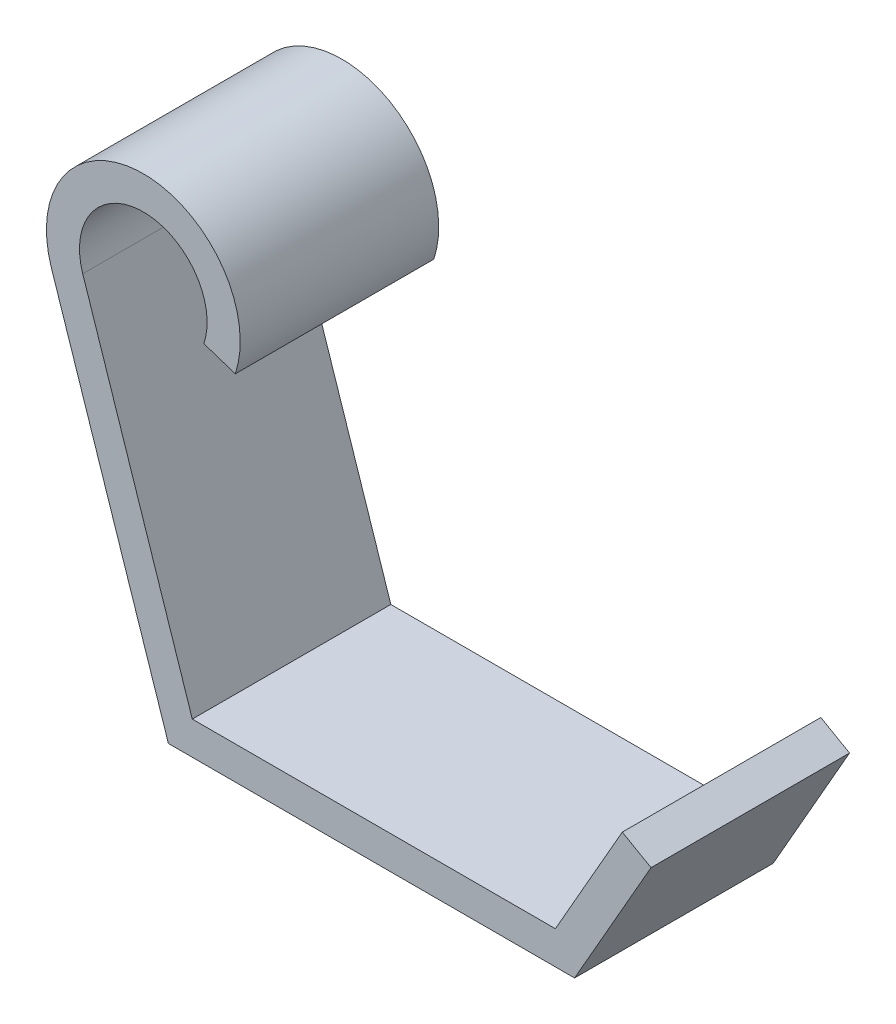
ISO-10303-21;
HEADER;
FILE_DESCRIPTION(('STEP AP214'),'2;1');
FILE_NAME('part.step','',(''),(''),'','','');
FILE_SCHEMA(('AUTOMOTIVE_DESIGN { 1 0 10303 214 1 1 1 1 }'));
ENDSEC;
DATA;
#1=APPLICATION_CONTEXT('core data for automotive mechanical design processes');
#2=APPLICATION_PROTOCOL_DEFINITION('international standard','automotive_design',2000,#1);
#3=PRODUCT_CONTEXT('',#1,'mechanical');
#4=PRODUCT('Part','Part','',(#3));
#5=PRODUCT_RELATED_PRODUCT_CATEGORY('part','',(#4));
#6=PRODUCT_DEFINITION_FORMATION('','',#4);
#7=PRODUCT_DEFINITION_CONTEXT('part definition',#1,'design');
#8=PRODUCT_DEFINITION('design','',#6,#7);
#9=PRODUCT_DEFINITION_SHAPE('','',#8);
#10=(LENGTH_UNIT() NAMED_UNIT(*) SI_UNIT(.MILLI.,.METRE.));
#11=(NAMED_UNIT(*) PLANE_ANGLE_UNIT() SI_UNIT($,.RADIAN.));
#12=(NAMED_UNIT(*) SI_UNIT($,.STERADIAN.) SOLID_ANGLE_UNIT());
#13=UNCERTAINTY_MEASURE_WITH_UNIT(LENGTH_MEASURE(1.E-05),#10,'distance_accuracy_value','');
#14=(GEOMETRIC_REPRESENTATION_CONTEXT(3) GLOBAL_UNCERTAINTY_ASSIGNED_CONTEXT((#13)) GLOBAL_UNIT_ASSIGNED_CONTEXT((#10,
#11,#12)) REPRESENTATION_CONTEXT('',''));
#15=CARTESIAN_POINT('',(0.,0.,0.));
#16=DIRECTION('',(0.,0.,1.));
#17=DIRECTION('',(1.,0.,0.));
#18=AXIS2_PLACEMENT_3D('',#15,#16,#17);
#19=CARTESIAN_POINT('',(-3.79088628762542,58.0354441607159,30.));
#20=DIRECTION('',(0.,0.,-1.));
#21=DIRECTION('',(-1.,0.,0.));
#22=AXIS2_PLACEMENT_3D('',#19,#20,#21);
#23=CYLINDRICAL_SURFACE('',#22,9.64192861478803);
#24=CARTESIAN_POINT('',(-3.79088628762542,58.0354441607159,0.));
#25=DIRECTION('',(0.,0.,1.));
#26=DIRECTION('',(1.,0.,0.));
#27=AXIS2_PLACEMENT_3D('',#24,#25,#26);
#28=CIRCLE('',#27,9.64192861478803);
#29=CARTESIAN_POINT('',(-12.9441887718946,55.0049588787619,0.));
#30=VERTEX_POINT('',#29);
#31=CARTESIAN_POINT('',(5.36241619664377,55.0049588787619,0.));
#32=VERTEX_POINT('',#31);
#33=EDGE_CURVE('E139',#30,#32,#28,.F.);
#34=ORIENTED_EDGE('',*,*,#33,.T.);
#35=DIRECTION('',(0.,0.,-1.));
#36=VECTOR('',#35,1.);
#37=CARTESIAN_POINT('',(5.36241619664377,55.0049588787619,30.));
#38=LINE('',#37,#36);
#39=CARTESIAN_POINT('',(5.36241619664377,55.0049588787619,30.));
#40=VERTEX_POINT('',#39);
#41=EDGE_CURVE('E11',#40,#32,#38,.T.);
#42=ORIENTED_EDGE('',*,*,#41,.F.);
#43=CARTESIAN_POINT('',(-3.79088628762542,58.0354441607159,30.));
#44=DIRECTION('',(0.,0.,1.));
#45=DIRECTION('',(1.,0.,0.));
#46=AXIS2_PLACEMENT_3D('',#43,#44,#45);
#47=CIRCLE('',#46,9.64192861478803);
#48=CARTESIAN_POINT('',(-12.9441887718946,55.0049588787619,30.));
#49=VERTEX_POINT('',#48);
#50=EDGE_CURVE('E94',#49,#40,#47,.F.);
#51=ORIENTED_EDGE('',*,*,#50,.F.);
#52=DIRECTION('',(0.,0.,-1.));
#53=VECTOR('',#52,1.);
#54=CARTESIAN_POINT('',(-12.9441887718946,55.0049588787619,30.));
#55=LINE('',#54,#53);
#56=EDGE_CURVE('E135',#49,#30,#55,.T.);
#57=ORIENTED_EDGE('',*,*,#56,.T.);
#58=EDGE_LOOP('',(#34,#42,#51,#57));
#59=FACE_BOUND('',#58,.T.);
#60=ADVANCED_FACE('F32',(#59),#23,.F.);
#61=CARTESIAN_POINT('',(10.1090301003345,53.4334448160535,30.));
#62=DIRECTION('',(-0.314302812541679,-0.949322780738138,0.));
#63=DIRECTION('',(0.949322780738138,-0.314302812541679,0.));
#64=AXIS2_PLACEMENT_3D('',#61,#62,#63);
#65=PLANE('',#64);
#66=DIRECTION('',(-0.949322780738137,0.314302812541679,0.));
#67=VECTOR('',#66,1.);
#68=CARTESIAN_POINT('',(10.1090301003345,53.4334448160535,0.));
#69=LINE('',#68,#67);
#70=CARTESIAN_POINT('',(10.1090301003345,53.4334448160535,0.));
#71=VERTEX_POINT('',#70);
#72=EDGE_CURVE('E142',#71,#32,#69,.T.);
#73=ORIENTED_EDGE('',*,*,#72,.F.);
#74=DIRECTION('',(0.,0.,-1.));
#75=VECTOR('',#74,1.);
#76=CARTESIAN_POINT('',(10.1090301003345,53.4334448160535,30.));
#77=LINE('',#76,#75);
#78=CARTESIAN_POINT('',(10.1090301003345,53.4334448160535,30.));
#79=VERTEX_POINT('',#78);
#80=EDGE_CURVE('E40',#79,#71,#77,.T.);
#81=ORIENTED_EDGE('',*,*,#80,.F.);
#82=DIRECTION('',(-0.949322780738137,0.314302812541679,0.));
#83=VECTOR('',#82,1.);
#84=CARTESIAN_POINT('',(10.1090301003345,53.4334448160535,30.));
#85=LINE('',#84,#83);
#86=EDGE_CURVE('E195',#79,#40,#85,.T.);
#87=ORIENTED_EDGE('',*,*,#86,.T.);
#88=ORIENTED_EDGE('',*,*,#41,.T.);
#89=EDGE_LOOP('',(#73,#81,#87,#88));
#90=FACE_BOUND('',#89,.T.);
#91=ADVANCED_FACE('F182',(#90),#65,.T.);
#92=CARTESIAN_POINT('',(-3.79088628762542,58.0354441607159,30.));
#93=DIRECTION('',(0.,0.,-1.));
#94=DIRECTION('',(-1.,0.,0.));
#95=AXIS2_PLACEMENT_3D('',#92,#93,#94);
#96=CYLINDRICAL_SURFACE('',#95,14.641928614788);
#97=CARTESIAN_POINT('',(-3.79088628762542,58.0354441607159,0.));
#98=DIRECTION('',(0.,0.,-1.));
#99=DIRECTION('',(-1.,0.,0.));
#100=AXIS2_PLACEMENT_3D('',#97,#98,#99);
#101=CIRCLE('',#100,14.641928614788);
#102=CARTESIAN_POINT('',(-17.6908026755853,53.4334448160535,0.));
#103=VERTEX_POINT('',#102);
#104=EDGE_CURVE('E145',#103,#71,#101,.T.);
#105=ORIENTED_EDGE('',*,*,#104,.F.);
#106=DIRECTION('',(0.,0.,-1.));
#107=VECTOR('',#106,1.);
#108=CARTESIAN_POINT('',(-17.6908026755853,53.4334448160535,30.));
#109=LINE('',#108,#107);
#110=CARTESIAN_POINT('',(-17.6908026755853,53.4334448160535,30.));
#111=VERTEX_POINT('',#110);
#112=EDGE_CURVE('E172',#111,#103,#109,.T.);
#113=ORIENTED_EDGE('',*,*,#112,.F.);
#114=CARTESIAN_POINT('',(-3.79088628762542,58.0354441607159,30.));
#115=DIRECTION('',(0.,0.,-1.));
#116=DIRECTION('',(-1.,0.,0.));
#117=AXIS2_PLACEMENT_3D('',#114,#115,#116);
#118=CIRCLE('',#117,14.641928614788);
#119=EDGE_CURVE('E179',#111,#79,#118,.T.);
#120=ORIENTED_EDGE('',*,*,#119,.T.);
#121=ORIENTED_EDGE('',*,*,#80,.T.);
#122=EDGE_LOOP('',(#105,#113,#120,#121));
#123=FACE_BOUND('',#122,.T.);
#124=ADVANCED_FACE('F177',(#123),#96,.T.);
#125=CARTESIAN_POINT('',(0.,0.,30.));
#126=DIRECTION('',(-0.949322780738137,-0.31430281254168,0.));
#127=DIRECTION('',(0.31430281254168,-0.949322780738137,0.));
#128=AXIS2_PLACEMENT_3D('',#125,#126,#127);
#129=PLANE('',#128);
#130=DIRECTION('',(-0.314302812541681,0.949322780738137,0.));
#131=VECTOR('',#130,1.);
#132=CARTESIAN_POINT('',(0.,0.,0.));
#133=LINE('',#132,#131);
#134=CARTESIAN_POINT('',(0.,0.,0.));
#135=VERTEX_POINT('',#134);
#136=EDGE_CURVE('E148',#135,#103,#133,.T.);
#137=ORIENTED_EDGE('',*,*,#136,.F.);
#138=DIRECTION('',(0.,0.,-1.));
#139=VECTOR('',#138,1.);
#140=CARTESIAN_POINT('',(0.,0.,30.));
#141=LINE('',#140,#139);
#142=CARTESIAN_POINT('',(0.,0.,30.));
#143=VERTEX_POINT('',#142);
#144=EDGE_CURVE('E170',#143,#135,#141,.T.);
#145=ORIENTED_EDGE('',*,*,#144,.F.);
#146=DIRECTION('',(-0.314302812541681,0.949322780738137,0.));
#147=VECTOR('',#146,1.);
#148=CARTESIAN_POINT('',(0.,0.,30.));
#149=LINE('',#148,#147);
#150=EDGE_CURVE('E192',#143,#111,#149,.T.);
#151=ORIENTED_EDGE('',*,*,#150,.T.);
#152=ORIENTED_EDGE('',*,*,#112,.T.);
#153=EDGE_LOOP('',(#137,#145,#151,#152));
#154=FACE_BOUND('',#153,.T.);
#155=ADVANCED_FACE('F189',(#154),#129,.T.);
#156=CARTESIAN_POINT('',(61.376254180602,0.,30.));
#157=DIRECTION('',(0.,-1.,0.));
#158=DIRECTION('',(0.,0.,-1.));
#159=AXIS2_PLACEMENT_3D('',#156,#157,#158);
#160=PLANE('',#159);
#161=DIRECTION('',(-1.,0.,0.));
#162=VECTOR('',#161,1.);
#163=CARTESIAN_POINT('',(61.376254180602,0.,0.));
#164=LINE('',#163,#162);
#165=CARTESIAN_POINT('',(61.376254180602,0.,0.));
#166=VERTEX_POINT('',#165);
#167=EDGE_CURVE('E151',#166,#135,#164,.T.);
#168=ORIENTED_EDGE('',*,*,#167,.F.);
#169=DIRECTION('',(0.,0.,-1.));
#170=VECTOR('',#169,1.);
#171=CARTESIAN_POINT('',(61.376254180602,0.,30.));
#172=LINE('',#171,#170);
#173=CARTESIAN_POINT('',(61.376254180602,0.,30.));
#174=VERTEX_POINT('',#173);
#175=EDGE_CURVE('E168',#174,#166,#172,.T.);
#176=ORIENTED_EDGE('',*,*,#175,.F.);
#177=DIRECTION('',(-1.,0.,0.));
#178=VECTOR('',#177,1.);
#179=CARTESIAN_POINT('',(61.376254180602,0.,30.));
#180=LINE('',#179,#178);
#181=EDGE_CURVE('E197',#174,#143,#180,.T.);
#182=ORIENTED_EDGE('',*,*,#181,.T.);
#183=ORIENTED_EDGE('',*,*,#144,.T.);
#184=EDGE_LOOP('',(#168,#176,#182,#183));
#185=FACE_BOUND('',#184,.T.);
#186=ADVANCED_FACE('F231',(#185),#160,.T.);
#187=CARTESIAN_POINT('',(72.9294314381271,20.2180602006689,30.));
#188=DIRECTION('',(0.868243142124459,-0.496138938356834,0.));
#189=DIRECTION('',(0.496138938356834,0.868243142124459,0.));
#190=AXIS2_PLACEMENT_3D('',#187,#188,#189);
#191=PLANE('',#190);
#192=DIRECTION('',(-0.496138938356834,-0.868243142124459,0.));
#193=VECTOR('',#192,1.);
#194=CARTESIAN_POINT('',(72.9294314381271,20.2180602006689,0.));
#195=LINE('',#194,#193);
#196=CARTESIAN_POINT('',(72.9294314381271,20.2180602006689,0.));
#197=VERTEX_POINT('',#196);
#198=EDGE_CURVE('E154',#197,#166,#195,.T.);
#199=ORIENTED_EDGE('',*,*,#198,.F.);
#200=DIRECTION('',(0.,0.,-1.));
#201=VECTOR('',#200,1.);
#202=CARTESIAN_POINT('',(72.9294314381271,20.2180602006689,30.));
#203=LINE('',#202,#201);
#204=CARTESIAN_POINT('',(72.9294314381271,20.2180602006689,30.));
#205=VERTEX_POINT('',#204);
#206=EDGE_CURVE('E166',#205,#197,#203,.T.);
#207=ORIENTED_EDGE('',*,*,#206,.F.);
#208=DIRECTION('',(-0.496138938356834,-0.868243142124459,0.));
#209=VECTOR('',#208,1.);
#210=CARTESIAN_POINT('',(72.9294314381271,20.2180602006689,30.));
#211=LINE('',#210,#209);
#212=EDGE_CURVE('E203',#205,#174,#211,.T.);
#213=ORIENTED_EDGE('',*,*,#212,.T.);
#214=ORIENTED_EDGE('',*,*,#175,.T.);
#215=EDGE_LOOP('',(#199,#207,#213,#214));
#216=FACE_BOUND('',#215,.T.);
#217=ADVANCED_FACE('F234',(#216),#191,.T.);
#218=CARTESIAN_POINT('',(68.5882157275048,22.6987548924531,30.));
#219=DIRECTION('',(0.496138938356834,0.868243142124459,0.));
#220=DIRECTION('',(-0.868243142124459,0.496138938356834,0.));
#221=AXIS2_PLACEMENT_3D('',#218,#219,#220);
#222=PLANE('',#221);
#223=DIRECTION('',(0.868243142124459,-0.496138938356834,0.));
#224=VECTOR('',#223,1.);
#225=CARTESIAN_POINT('',(68.5882157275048,22.6987548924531,0.));
#226=LINE('',#225,#224);
#227=CARTESIAN_POINT('',(68.5882157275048,22.6987548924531,0.));
#228=VERTEX_POINT('',#227);
#229=EDGE_CURVE('E157',#228,#197,#226,.T.);
#230=ORIENTED_EDGE('',*,*,#229,.F.);
#231=DIRECTION('',(0.,0.,-1.));
#232=VECTOR('',#231,1.);
#233=CARTESIAN_POINT('',(68.5882157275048,22.6987548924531,30.));
#234=LINE('',#233,#232);
#235=CARTESIAN_POINT('',(68.5882157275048,22.6987548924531,30.));
#236=VERTEX_POINT('',#235);
#237=EDGE_CURVE('E130',#236,#228,#234,.T.);
#238=ORIENTED_EDGE('',*,*,#237,.F.);
#239=DIRECTION('',(0.868243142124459,-0.496138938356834,0.));
#240=VECTOR('',#239,1.);
#241=CARTESIAN_POINT('',(68.5882157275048,22.6987548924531,30.));
#242=LINE('',#241,#240);
#243=EDGE_CURVE('E123',#236,#205,#242,.T.);
#244=ORIENTED_EDGE('',*,*,#243,.T.);
#245=ORIENTED_EDGE('',*,*,#206,.T.);
#246=EDGE_LOOP('',(#230,#238,#244,#245));
#247=FACE_BOUND('',#246,.T.);
#248=ADVANCED_FACE('F207',(#247),#222,.T.);
#249=CARTESIAN_POINT('',(68.5882157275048,22.6987548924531,30.));
#250=DIRECTION('',(0.868243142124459,-0.496138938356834,0.));
#251=DIRECTION('',(0.496138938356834,0.868243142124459,0.));
#252=AXIS2_PLACEMENT_3D('',#249,#250,#251);
#253=PLANE('',#252);
#254=DIRECTION('',(-0.496138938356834,-0.868243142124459,0.));
#255=VECTOR('',#254,1.);
#256=CARTESIAN_POINT('',(68.5882157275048,22.6987548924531,0.));
#257=LINE('',#256,#255);
#258=CARTESIAN_POINT('',(58.4746415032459,5.,0.));
#259=VERTEX_POINT('',#258);
#260=EDGE_CURVE('E129',#228,#259,#257,.T.);
#261=ORIENTED_EDGE('',*,*,#260,.T.);
#262=DIRECTION('',(0.,0.,-1.));
#263=VECTOR('',#262,1.);
#264=CARTESIAN_POINT('',(58.4746415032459,5.,30.));
#265=LINE('',#264,#263);
#266=CARTESIAN_POINT('',(58.4746415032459,5.,30.));
#267=VERTEX_POINT('',#266);
#268=EDGE_CURVE('E126',#267,#259,#265,.T.);
#269=ORIENTED_EDGE('',*,*,#268,.F.);
#270=DIRECTION('',(-0.496138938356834,-0.868243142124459,0.));
#271=VECTOR('',#270,1.);
#272=CARTESIAN_POINT('',(68.5882157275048,22.6987548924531,30.));
#273=LINE('',#272,#271);
#274=EDGE_CURVE('E116',#236,#267,#273,.T.);
#275=ORIENTED_EDGE('',*,*,#274,.F.);
#276=ORIENTED_EDGE('',*,*,#237,.T.);
#277=EDGE_LOOP('',(#261,#269,#275,#276));
#278=FACE_BOUND('',#277,.T.);
#279=ADVANCED_FACE('F127',(#278),#253,.F.);
#280=CARTESIAN_POINT('',(61.376254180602,5.,30.));
#281=DIRECTION('',(0.,-1.,0.));
#282=DIRECTION('',(0.,0.,-1.));
#283=AXIS2_PLACEMENT_3D('',#280,#281,#282);
#284=PLANE('',#283);
#285=DIRECTION('',(1.,0.,0.));
#286=VECTOR('',#285,1.);
#287=CARTESIAN_POINT('',(61.376254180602,5.,0.));
#288=LINE('',#287,#286);
#289=CARTESIAN_POINT('',(3.6115070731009,5.,0.));
#290=VERTEX_POINT('',#289);
#291=EDGE_CURVE('E82',#259,#290,#288,.F.);
#292=ORIENTED_EDGE('',*,*,#291,.T.);
#293=DIRECTION('',(0.,0.,-1.));
#294=VECTOR('',#293,1.);
#295=CARTESIAN_POINT('',(3.6115070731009,5.,30.));
#296=LINE('',#295,#294);
#297=CARTESIAN_POINT('',(3.6115070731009,5.,30.));
#298=VERTEX_POINT('',#297);
#299=EDGE_CURVE('E131',#298,#290,#296,.T.);
#300=ORIENTED_EDGE('',*,*,#299,.F.);
#301=DIRECTION('',(1.,0.,0.));
#302=VECTOR('',#301,1.);
#303=CARTESIAN_POINT('',(61.376254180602,5.,30.));
#304=LINE('',#303,#302);
#305=EDGE_CURVE('E120',#267,#298,#304,.F.);
#306=ORIENTED_EDGE('',*,*,#305,.F.);
#307=ORIENTED_EDGE('',*,*,#268,.T.);
#308=EDGE_LOOP('',(#292,#300,#306,#307));
#309=FACE_BOUND('',#308,.T.);
#310=ADVANCED_FACE('F133',(#309),#284,.F.);
#311=CARTESIAN_POINT('',(4.74661390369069,1.5715140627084,30.));
#312=DIRECTION('',(-0.949322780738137,-0.31430281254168,0.));
#313=DIRECTION('',(0.31430281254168,-0.949322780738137,0.));
#314=AXIS2_PLACEMENT_3D('',#311,#312,#313);
#315=PLANE('',#314);
#316=DIRECTION('',(-0.314302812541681,0.949322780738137,0.));
#317=VECTOR('',#316,1.);
#318=CARTESIAN_POINT('',(4.74661390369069,1.5715140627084,0.));
#319=LINE('',#318,#317);
#320=EDGE_CURVE('E88',#290,#30,#319,.T.);
#321=ORIENTED_EDGE('',*,*,#320,.T.);
#322=ORIENTED_EDGE('',*,*,#56,.F.);
#323=DIRECTION('',(-0.314302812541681,0.949322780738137,0.));
#324=VECTOR('',#323,1.);
#325=CARTESIAN_POINT('',(4.74661390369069,1.5715140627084,30.));
#326=LINE('',#325,#324);
#327=EDGE_CURVE('E48',#298,#49,#326,.T.);
#328=ORIENTED_EDGE('',*,*,#327,.F.);
#329=ORIENTED_EDGE('',*,*,#299,.T.);
#330=EDGE_LOOP('',(#321,#322,#328,#329));
#331=FACE_BOUND('',#330,.T.);
#332=ADVANCED_FACE('F210',(#331),#315,.F.);
#333=CARTESIAN_POINT('',(-3.79088628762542,58.0354441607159,30.));
#334=DIRECTION('',(0.,0.,1.));
#335=DIRECTION('',(1.,0.,0.));
#336=AXIS2_PLACEMENT_3D('',#333,#334,#335);
#337=PLANE('',#336);
#338=ORIENTED_EDGE('',*,*,#50,.T.);
#339=ORIENTED_EDGE('',*,*,#86,.F.);
#340=ORIENTED_EDGE('',*,*,#119,.F.);
#341=ORIENTED_EDGE('',*,*,#150,.F.);
#342=ORIENTED_EDGE('',*,*,#181,.F.);
#343=ORIENTED_EDGE('',*,*,#212,.F.);
#344=ORIENTED_EDGE('',*,*,#243,.F.);
#345=ORIENTED_EDGE('',*,*,#274,.T.);
#346=ORIENTED_EDGE('',*,*,#305,.T.);
#347=ORIENTED_EDGE('',*,*,#327,.T.);
#348=EDGE_LOOP('',(#338,#339,#340,#341,#342,#343,#344,#345,#346,#347));
#349=FACE_BOUND('',#348,.T.);
#350=ADVANCED_FACE('F118',(#349),#337,.T.);
#351=CARTESIAN_POINT('',(-3.79088628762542,58.0354441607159,0.));
#352=DIRECTION('',(0.,0.,1.));
#353=DIRECTION('',(1.,0.,0.));
#354=AXIS2_PLACEMENT_3D('',#351,#352,#353);
#355=PLANE('',#354);
#356=ORIENTED_EDGE('',*,*,#33,.F.);
#357=ORIENTED_EDGE('',*,*,#320,.F.);
#358=ORIENTED_EDGE('',*,*,#291,.F.);
#359=ORIENTED_EDGE('',*,*,#260,.F.);
#360=ORIENTED_EDGE('',*,*,#229,.T.);
#361=ORIENTED_EDGE('',*,*,#198,.T.);
#362=ORIENTED_EDGE('',*,*,#167,.T.);
#363=ORIENTED_EDGE('',*,*,#136,.T.);
#364=ORIENTED_EDGE('',*,*,#104,.T.);
#365=ORIENTED_EDGE('',*,*,#72,.T.);
#366=EDGE_LOOP('',(#356,#357,#358,#359,#360,#361,#362,#363,#364,#365));
#367=FACE_BOUND('',#366,.T.);
#368=ADVANCED_FACE('F185',(#367),#355,.F.);
#369=CLOSED_SHELL('',(#60,#91,#124,#155,#186,#217,#248,#279,#310,#332,#350,#368));
#370=MANIFOLD_SOLID_BREP('B2',#369);
#371=ADVANCED_BREP_SHAPE_REPRESENTATION('',(#18,#370),#14);
#372=SHAPE_DEFINITION_REPRESENTATION(#9,#371);
ENDSEC;
END-ISO-10303-21;
